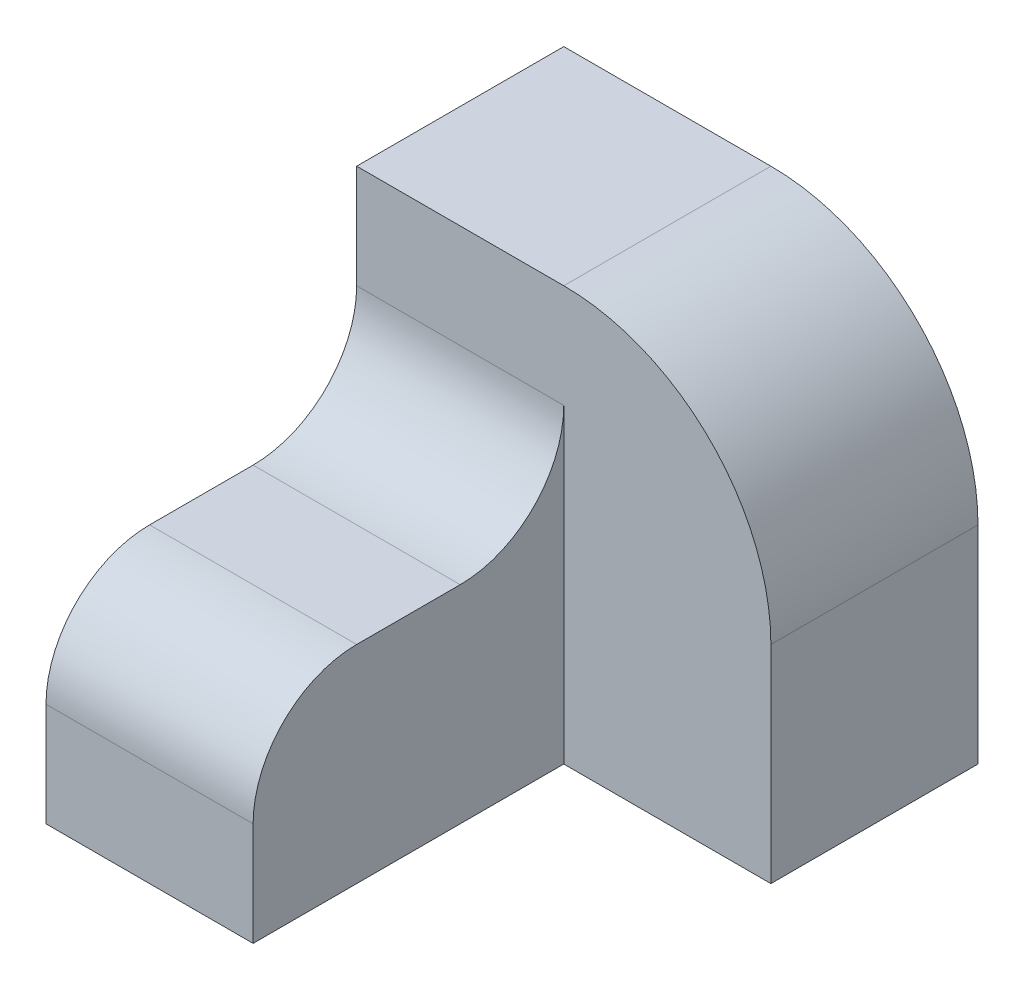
ISO-10303-21;
HEADER;
FILE_DESCRIPTION(('STEP AP214'),'2;1');
FILE_NAME('part.step','',(''),(''),'','','');
FILE_SCHEMA(('AUTOMOTIVE_DESIGN { 1 0 10303 214 1 1 1 1 }'));
ENDSEC;
DATA;
#1=APPLICATION_CONTEXT('core data for automotive mechanical design processes');
#2=APPLICATION_PROTOCOL_DEFINITION('international standard','automotive_design',2000,#1);
#3=PRODUCT_CONTEXT('',#1,'mechanical');
#4=PRODUCT('Part','Part','',(#3));
#5=PRODUCT_RELATED_PRODUCT_CATEGORY('part','',(#4));
#6=PRODUCT_DEFINITION_FORMATION('','',#4);
#7=PRODUCT_DEFINITION_CONTEXT('part definition',#1,'design');
#8=PRODUCT_DEFINITION('design','',#6,#7);
#9=PRODUCT_DEFINITION_SHAPE('','',#8);
#10=(LENGTH_UNIT() NAMED_UNIT(*) SI_UNIT(.MILLI.,.METRE.));
#11=(NAMED_UNIT(*) PLANE_ANGLE_UNIT() SI_UNIT($,.RADIAN.));
#12=(NAMED_UNIT(*) SI_UNIT($,.STERADIAN.) SOLID_ANGLE_UNIT());
#13=UNCERTAINTY_MEASURE_WITH_UNIT(LENGTH_MEASURE(1.E-05),#10,'distance_accuracy_value','');
#14=(GEOMETRIC_REPRESENTATION_CONTEXT(3) GLOBAL_UNCERTAINTY_ASSIGNED_CONTEXT((#13)) GLOBAL_UNIT_ASSIGNED_CONTEXT((#10,
#11,#12)) REPRESENTATION_CONTEXT('',''));
#15=CARTESIAN_POINT('',(0.,0.,0.));
#16=DIRECTION('',(0.,0.,1.));
#17=DIRECTION('',(1.,0.,0.));
#18=AXIS2_PLACEMENT_3D('',#15,#16,#17);
#19=CARTESIAN_POINT('',(20.,-24.1414213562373,50.));
#20=DIRECTION('',(1.,0.,0.));
#21=DIRECTION('',(0.,1.,0.));
#22=AXIS2_PLACEMENT_3D('',#19,#20,#21);
#23=PLANE('',#22);
#24=DIRECTION('',(0.,0.,-1.));
#25=VECTOR('',#24,1.);
#26=CARTESIAN_POINT('',(20.,20.,50.));
#27=LINE('',#26,#25);
#28=CARTESIAN_POINT('',(20.,20.,40.));
#29=VERTEX_POINT('',#28);
#30=CARTESIAN_POINT('',(20.,20.,30.));
#31=VERTEX_POINT('',#30);
#32=EDGE_CURVE('E147',#29,#31,#27,.T.);
#33=ORIENTED_EDGE('',*,*,#32,.F.);
#34=CARTESIAN_POINT('',(20.,10.,40.));
#35=DIRECTION('',(1.,0.,0.));
#36=DIRECTION('',(0.,1.,0.));
#37=AXIS2_PLACEMENT_3D('',#34,#35,#36);
#38=CIRCLE('',#37,10.);
#39=CARTESIAN_POINT('',(20.,10.,50.));
#40=VERTEX_POINT('',#39);
#41=EDGE_CURVE('E156',#29,#40,#38,.T.);
#42=ORIENTED_EDGE('',*,*,#41,.T.);
#43=DIRECTION('',(0.,-1.,0.));
#44=VECTOR('',#43,1.);
#45=CARTESIAN_POINT('',(20.,-24.1414213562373,50.));
#46=LINE('',#45,#44);
#47=CARTESIAN_POINT('',(20.,0.,50.));
#48=VERTEX_POINT('',#47);
#49=EDGE_CURVE('E132',#40,#48,#46,.T.);
#50=ORIENTED_EDGE('',*,*,#49,.T.);
#51=DIRECTION('',(0.,0.,-1.));
#52=VECTOR('',#51,1.);
#53=CARTESIAN_POINT('',(20.,0.,50.));
#54=LINE('',#53,#52);
#55=CARTESIAN_POINT('',(20.,0.,20.));
#56=VERTEX_POINT('',#55);
#57=EDGE_CURVE('E125',#48,#56,#54,.T.);
#58=ORIENTED_EDGE('',*,*,#57,.T.);
#59=DIRECTION('',(0.,-1.,0.));
#60=VECTOR('',#59,1.);
#61=CARTESIAN_POINT('',(20.,-24.1414213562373,20.));
#62=LINE('',#61,#60);
#63=CARTESIAN_POINT('',(20.,30.,20.));
#64=VERTEX_POINT('',#63);
#65=EDGE_CURVE('E108',#64,#56,#62,.T.);
#66=ORIENTED_EDGE('',*,*,#65,.F.);
#67=CARTESIAN_POINT('',(20.,30.,30.));
#68=DIRECTION('',(1.,0.,0.));
#69=DIRECTION('',(0.,1.,0.));
#70=AXIS2_PLACEMENT_3D('',#67,#68,#69);
#71=CIRCLE('',#70,10.);
#72=EDGE_CURVE('E162',#64,#31,#71,.F.);
#73=ORIENTED_EDGE('',*,*,#72,.T.);
#74=EDGE_LOOP('',(#33,#42,#50,#58,#66,#73));
#75=FACE_BOUND('',#74,.T.);
#76=ADVANCED_FACE('F32',(#75),#23,.T.);
#77=CARTESIAN_POINT('',(20.,20.,50.));
#78=DIRECTION('',(0.,1.,0.));
#79=DIRECTION('',(0.,0.,1.));
#80=AXIS2_PLACEMENT_3D('',#77,#78,#79);
#81=PLANE('',#80);
#82=ORIENTED_EDGE('',*,*,#32,.T.);
#83=DIRECTION('',(1.,0.,0.));
#84=VECTOR('',#83,1.);
#85=CARTESIAN_POINT('',(0.,20.,30.));
#86=LINE('',#85,#84);
#87=CARTESIAN_POINT('',(0.,20.,30.));
#88=VERTEX_POINT('',#87);
#89=EDGE_CURVE('E154',#31,#88,#86,.F.);
#90=ORIENTED_EDGE('',*,*,#89,.T.);
#91=DIRECTION('',(0.,0.,-1.));
#92=VECTOR('',#91,1.);
#93=CARTESIAN_POINT('',(0.,20.,50.));
#94=LINE('',#93,#92);
#95=CARTESIAN_POINT('',(0.,20.,40.));
#96=VERTEX_POINT('',#95);
#97=EDGE_CURVE('E137',#96,#88,#94,.T.);
#98=ORIENTED_EDGE('',*,*,#97,.F.);
#99=DIRECTION('',(1.,0.,0.));
#100=VECTOR('',#99,1.);
#101=CARTESIAN_POINT('',(20.,20.,40.));
#102=LINE('',#101,#100);
#103=EDGE_CURVE('E151',#96,#29,#102,.T.);
#104=ORIENTED_EDGE('',*,*,#103,.T.);
#105=EDGE_LOOP('',(#82,#90,#98,#104));
#106=FACE_BOUND('',#105,.T.);
#107=ADVANCED_FACE('F209',(#106),#81,.T.);
#108=CARTESIAN_POINT('',(0.,-24.1414213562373,50.));
#109=DIRECTION('',(-1.,0.,0.));
#110=DIRECTION('',(0.,0.,1.));
#111=AXIS2_PLACEMENT_3D('',#108,#109,#110);
#112=PLANE('',#111);
#113=DIRECTION('',(0.,1.,0.));
#114=VECTOR('',#113,1.);
#115=CARTESIAN_POINT('',(0.,-24.1414213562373,50.));
#116=LINE('',#115,#114);
#117=CARTESIAN_POINT('',(0.,0.,50.));
#118=VERTEX_POINT('',#117);
#119=CARTESIAN_POINT('',(0.,10.,50.));
#120=VERTEX_POINT('',#119);
#121=EDGE_CURVE('E139',#118,#120,#116,.T.);
#122=ORIENTED_EDGE('',*,*,#121,.T.);
#123=CARTESIAN_POINT('',(0.,10.,40.));
#124=DIRECTION('',(-1.,0.,0.));
#125=DIRECTION('',(0.,0.,1.));
#126=AXIS2_PLACEMENT_3D('',#123,#124,#125);
#127=CIRCLE('',#126,10.);
#128=EDGE_CURVE('E160',#120,#96,#127,.T.);
#129=ORIENTED_EDGE('',*,*,#128,.T.);
#130=ORIENTED_EDGE('',*,*,#97,.T.);
#131=CARTESIAN_POINT('',(0.,30.,30.));
#132=DIRECTION('',(-1.,0.,0.));
#133=DIRECTION('',(0.,0.,1.));
#134=AXIS2_PLACEMENT_3D('',#131,#132,#133);
#135=CIRCLE('',#134,10.);
#136=CARTESIAN_POINT('',(0.,30.,20.));
#137=VERTEX_POINT('',#136);
#138=EDGE_CURVE('E164',#88,#137,#135,.F.);
#139=ORIENTED_EDGE('',*,*,#138,.T.);
#140=DIRECTION('',(0.,1.,0.));
#141=VECTOR('',#140,1.);
#142=CARTESIAN_POINT('',(0.,-24.1414213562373,20.));
#143=LINE('',#142,#141);
#144=CARTESIAN_POINT('',(0.,40.,20.));
#145=VERTEX_POINT('',#144);
#146=EDGE_CURVE('E191',#137,#145,#143,.T.);
#147=ORIENTED_EDGE('',*,*,#146,.T.);
#148=DIRECTION('',(0.,0.,-1.));
#149=VECTOR('',#148,1.);
#150=CARTESIAN_POINT('',(0.,40.,20.));
#151=LINE('',#150,#149);
#152=CARTESIAN_POINT('',(0.,40.,0.));
#153=VERTEX_POINT('',#152);
#154=EDGE_CURVE('E189',#145,#153,#151,.T.);
#155=ORIENTED_EDGE('',*,*,#154,.T.);
#156=DIRECTION('',(0.,1.,0.));
#157=VECTOR('',#156,1.);
#158=CARTESIAN_POINT('',(0.,-24.1414213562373,0.));
#159=LINE('',#158,#157);
#160=CARTESIAN_POINT('',(0.,0.,0.));
#161=VERTEX_POINT('',#160);
#162=EDGE_CURVE('E182',#161,#153,#159,.T.);
#163=ORIENTED_EDGE('',*,*,#162,.F.);
#164=DIRECTION('',(0.,0.,-1.));
#165=VECTOR('',#164,1.);
#166=CARTESIAN_POINT('',(0.,0.,50.));
#167=LINE('',#166,#165);
#168=EDGE_CURVE('E134',#118,#161,#167,.T.);
#169=ORIENTED_EDGE('',*,*,#168,.F.);
#170=EDGE_LOOP('',(#122,#129,#130,#139,#147,#155,#163,#169));
#171=FACE_BOUND('',#170,.T.);
#172=ADVANCED_FACE('F199',(#171),#112,.T.);
#173=CARTESIAN_POINT('',(20.,0.,50.));
#174=DIRECTION('',(0.,1.,0.));
#175=DIRECTION('',(0.,0.,1.));
#176=AXIS2_PLACEMENT_3D('',#173,#174,#175);
#177=PLANE('',#176);
#178=DIRECTION('',(1.,0.,0.));
#179=VECTOR('',#178,1.);
#180=CARTESIAN_POINT('',(20.,0.,0.));
#181=LINE('',#180,#179);
#182=CARTESIAN_POINT('',(40.,0.,0.));
#183=VERTEX_POINT('',#182);
#184=EDGE_CURVE('E142',#161,#183,#181,.T.);
#185=ORIENTED_EDGE('',*,*,#184,.T.);
#186=DIRECTION('',(0.,0.,-1.));
#187=VECTOR('',#186,1.);
#188=CARTESIAN_POINT('',(40.,0.,20.));
#189=LINE('',#188,#187);
#190=CARTESIAN_POINT('',(40.,0.,20.));
#191=VERTEX_POINT('',#190);
#192=EDGE_CURVE('E127',#191,#183,#189,.T.);
#193=ORIENTED_EDGE('',*,*,#192,.F.);
#194=DIRECTION('',(1.,0.,0.));
#195=VECTOR('',#194,1.);
#196=CARTESIAN_POINT('',(20.,0.,20.));
#197=LINE('',#196,#195);
#198=EDGE_CURVE('E111',#56,#191,#197,.T.);
#199=ORIENTED_EDGE('',*,*,#198,.F.);
#200=ORIENTED_EDGE('',*,*,#57,.F.);
#201=DIRECTION('',(1.,0.,0.));
#202=VECTOR('',#201,1.);
#203=CARTESIAN_POINT('',(20.,0.,50.));
#204=LINE('',#203,#202);
#205=EDGE_CURVE('E135',#118,#48,#204,.T.);
#206=ORIENTED_EDGE('',*,*,#205,.F.);
#207=ORIENTED_EDGE('',*,*,#168,.T.);
#208=EDGE_LOOP('',(#185,#193,#199,#200,#206,#207));
#209=FACE_BOUND('',#208,.T.);
#210=ADVANCED_FACE('F123',(#209),#177,.F.);
#211=CARTESIAN_POINT('',(20.,-24.1414213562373,50.));
#212=DIRECTION('',(0.,0.,1.));
#213=DIRECTION('',(1.,0.,0.));
#214=AXIS2_PLACEMENT_3D('',#211,#212,#213);
#215=PLANE('',#214);
#216=ORIENTED_EDGE('',*,*,#49,.F.);
#217=DIRECTION('',(1.,0.,0.));
#218=VECTOR('',#217,1.);
#219=CARTESIAN_POINT('',(20.,10.,50.));
#220=LINE('',#219,#218);
#221=EDGE_CURVE('E158',#40,#120,#220,.F.);
#222=ORIENTED_EDGE('',*,*,#221,.T.);
#223=ORIENTED_EDGE('',*,*,#121,.F.);
#224=ORIENTED_EDGE('',*,*,#205,.T.);
#225=EDGE_LOOP('',(#216,#222,#223,#224));
#226=FACE_BOUND('',#225,.T.);
#227=ADVANCED_FACE('F230',(#226),#215,.T.);
#228=CARTESIAN_POINT('',(20.,-24.1414213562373,0.));
#229=DIRECTION('',(0.,0.,1.));
#230=DIRECTION('',(1.,0.,0.));
#231=AXIS2_PLACEMENT_3D('',#228,#229,#230);
#232=PLANE('',#231);
#233=DIRECTION('',(1.,0.,0.));
#234=VECTOR('',#233,1.);
#235=CARTESIAN_POINT('',(20.,40.,0.));
#236=LINE('',#235,#234);
#237=CARTESIAN_POINT('',(20.,40.,0.));
#238=VERTEX_POINT('',#237);
#239=EDGE_CURVE('E119',#153,#238,#236,.T.);
#240=ORIENTED_EDGE('',*,*,#239,.T.);
#241=CARTESIAN_POINT('',(20.,20.,0.));
#242=DIRECTION('',(0.,0.,1.));
#243=DIRECTION('',(1.,0.,0.));
#244=AXIS2_PLACEMENT_3D('',#241,#242,#243);
#245=CIRCLE('',#244,20.);
#246=CARTESIAN_POINT('',(40.,20.,0.));
#247=VERTEX_POINT('',#246);
#248=EDGE_CURVE('E54',#238,#247,#245,.F.);
#249=ORIENTED_EDGE('',*,*,#248,.T.);
#250=DIRECTION('',(0.,1.,0.));
#251=VECTOR('',#250,1.);
#252=CARTESIAN_POINT('',(40.,-24.1414213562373,0.));
#253=LINE('',#252,#251);
#254=EDGE_CURVE('E184',#183,#247,#253,.T.);
#255=ORIENTED_EDGE('',*,*,#254,.F.);
#256=ORIENTED_EDGE('',*,*,#184,.F.);
#257=ORIENTED_EDGE('',*,*,#162,.T.);
#258=EDGE_LOOP('',(#240,#249,#255,#256,#257));
#259=FACE_BOUND('',#258,.T.);
#260=ADVANCED_FACE('F179',(#259),#232,.F.);
#261=CARTESIAN_POINT('',(40.,-24.1414213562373,20.));
#262=DIRECTION('',(-1.,0.,0.));
#263=DIRECTION('',(0.,-1.,0.));
#264=AXIS2_PLACEMENT_3D('',#261,#262,#263);
#265=PLANE('',#264);
#266=ORIENTED_EDGE('',*,*,#254,.T.);
#267=DIRECTION('',(0.,0.,-1.));
#268=VECTOR('',#267,1.);
#269=CARTESIAN_POINT('',(40.,20.,20.));
#270=LINE('',#269,#268);
#271=CARTESIAN_POINT('',(40.,20.,20.));
#272=VERTEX_POINT('',#271);
#273=EDGE_CURVE('E40',#247,#272,#270,.F.);
#274=ORIENTED_EDGE('',*,*,#273,.T.);
#275=DIRECTION('',(0.,1.,0.));
#276=VECTOR('',#275,1.);
#277=CARTESIAN_POINT('',(40.,-24.1414213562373,20.));
#278=LINE('',#277,#276);
#279=EDGE_CURVE('E128',#191,#272,#278,.T.);
#280=ORIENTED_EDGE('',*,*,#279,.F.);
#281=ORIENTED_EDGE('',*,*,#192,.T.);
#282=EDGE_LOOP('',(#266,#274,#280,#281));
#283=FACE_BOUND('',#282,.T.);
#284=ADVANCED_FACE('F195',(#283),#265,.F.);
#285=CARTESIAN_POINT('',(20.,40.,20.));
#286=DIRECTION('',(0.,1.,0.));
#287=DIRECTION('',(0.,0.,1.));
#288=AXIS2_PLACEMENT_3D('',#285,#286,#287);
#289=PLANE('',#288);
#290=DIRECTION('',(1.,0.,0.));
#291=VECTOR('',#290,1.);
#292=CARTESIAN_POINT('',(20.,40.,20.));
#293=LINE('',#292,#291);
#294=CARTESIAN_POINT('',(20.,40.,20.));
#295=VERTEX_POINT('',#294);
#296=EDGE_CURVE('E176',#145,#295,#293,.T.);
#297=ORIENTED_EDGE('',*,*,#296,.T.);
#298=DIRECTION('',(0.,0.,-1.));
#299=VECTOR('',#298,1.);
#300=CARTESIAN_POINT('',(20.,40.,0.));
#301=LINE('',#300,#299);
#302=EDGE_CURVE('E166',#295,#238,#301,.T.);
#303=ORIENTED_EDGE('',*,*,#302,.T.);
#304=ORIENTED_EDGE('',*,*,#239,.F.);
#305=ORIENTED_EDGE('',*,*,#154,.F.);
#306=EDGE_LOOP('',(#297,#303,#304,#305));
#307=FACE_BOUND('',#306,.T.);
#308=ADVANCED_FACE('F173',(#307),#289,.T.);
#309=CARTESIAN_POINT('',(20.,-24.1414213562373,20.));
#310=DIRECTION('',(0.,0.,1.));
#311=DIRECTION('',(1.,0.,0.));
#312=AXIS2_PLACEMENT_3D('',#309,#310,#311);
#313=PLANE('',#312);
#314=ORIENTED_EDGE('',*,*,#279,.T.);
#315=CARTESIAN_POINT('',(20.,20.,20.));
#316=DIRECTION('',(0.,0.,1.));
#317=DIRECTION('',(1.,0.,0.));
#318=AXIS2_PLACEMENT_3D('',#315,#316,#317);
#319=CIRCLE('',#318,20.);
#320=EDGE_CURVE('E11',#272,#295,#319,.T.);
#321=ORIENTED_EDGE('',*,*,#320,.T.);
#322=ORIENTED_EDGE('',*,*,#296,.F.);
#323=ORIENTED_EDGE('',*,*,#146,.F.);
#324=DIRECTION('',(1.,0.,0.));
#325=VECTOR('',#324,1.);
#326=CARTESIAN_POINT('',(20.,30.,20.));
#327=LINE('',#326,#325);
#328=EDGE_CURVE('E115',#137,#64,#327,.T.);
#329=ORIENTED_EDGE('',*,*,#328,.T.);
#330=ORIENTED_EDGE('',*,*,#65,.T.);
#331=ORIENTED_EDGE('',*,*,#198,.T.);
#332=EDGE_LOOP('',(#314,#321,#322,#323,#329,#330,#331));
#333=FACE_BOUND('',#332,.T.);
#334=ADVANCED_FACE('F110',(#333),#313,.T.);
#335=CARTESIAN_POINT('',(20.,30.,30.));
#336=DIRECTION('',(-1.,0.,0.));
#337=DIRECTION('',(0.,0.,1.));
#338=AXIS2_PLACEMENT_3D('',#335,#336,#337);
#339=CYLINDRICAL_SURFACE('',#338,10.);
#340=ORIENTED_EDGE('',*,*,#138,.F.);
#341=ORIENTED_EDGE('',*,*,#89,.F.);
#342=ORIENTED_EDGE('',*,*,#72,.F.);
#343=ORIENTED_EDGE('',*,*,#328,.F.);
#344=EDGE_LOOP('',(#340,#341,#342,#343));
#345=FACE_BOUND('',#344,.T.);
#346=ADVANCED_FACE('F206',(#345),#339,.F.);
#347=CARTESIAN_POINT('',(20.,10.,40.));
#348=DIRECTION('',(1.,0.,0.));
#349=DIRECTION('',(0.,0.,-1.));
#350=AXIS2_PLACEMENT_3D('',#347,#348,#349);
#351=CYLINDRICAL_SURFACE('',#350,10.);
#352=ORIENTED_EDGE('',*,*,#128,.F.);
#353=ORIENTED_EDGE('',*,*,#221,.F.);
#354=ORIENTED_EDGE('',*,*,#41,.F.);
#355=ORIENTED_EDGE('',*,*,#103,.F.);
#356=EDGE_LOOP('',(#352,#353,#354,#355));
#357=FACE_BOUND('',#356,.T.);
#358=ADVANCED_FACE('F202',(#357),#351,.T.);
#359=CARTESIAN_POINT('',(20.,20.,20.));
#360=DIRECTION('',(0.,0.,1.));
#361=DIRECTION('',(1.,0.,0.));
#362=AXIS2_PLACEMENT_3D('',#359,#360,#361);
#363=CYLINDRICAL_SURFACE('',#362,20.);
#364=ORIENTED_EDGE('',*,*,#320,.F.);
#365=ORIENTED_EDGE('',*,*,#273,.F.);
#366=ORIENTED_EDGE('',*,*,#248,.F.);
#367=ORIENTED_EDGE('',*,*,#302,.F.);
#368=EDGE_LOOP('',(#364,#365,#366,#367));
#369=FACE_BOUND('',#368,.T.);
#370=ADVANCED_FACE('F34',(#369),#363,.T.);
#371=CLOSED_SHELL('',(#76,#107,#172,#210,#227,#260,#284,#308,#334,#346,#358,#370));
#372=MANIFOLD_SOLID_BREP('B2',#371);
#373=ADVANCED_BREP_SHAPE_REPRESENTATION('',(#18,#372),#14);
#374=SHAPE_DEFINITION_REPRESENTATION(#9,#373);
ENDSEC;
END-ISO-10303-21;
